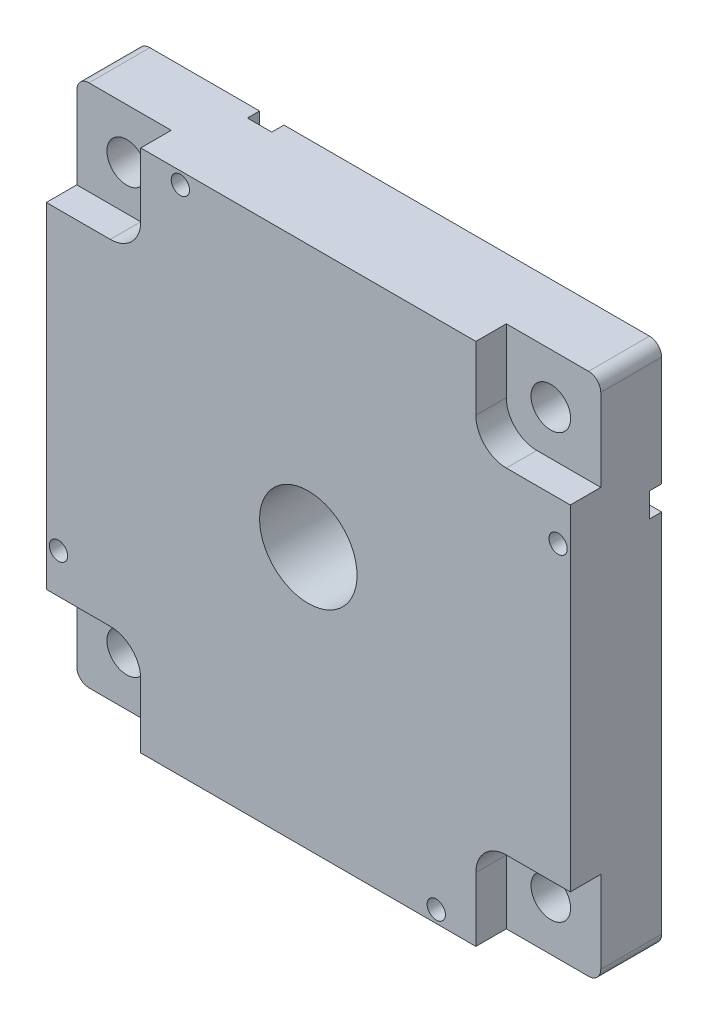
from build123d import *

# Parameters (mm, degrees)
SKETCH_2_W               = 86
SKETCH_2_H               = 86
EXTRUDE_1_DEPTH          = 10
SKETCH_3_R               = 3.25
CUT_EXTRUDE_1_DEPTH      = 10
SKETCH_4_R               = 37
SKETCH_4_R_2             = 36.5
CUT_EXTRUDE_2_DEPTH      = 0.5
EXTRUDE_START            = 1.6
SKETCH_5_R               = 36.5
EXTRUDE_2_DEPTH          = 1.6
SKETCH_6_R               = 21
SKETCH_6_R_2             = 20
CUT_EXTRUDE_3_DEPTH      = 0.5
SKETCH_7_R               = 8
CUT_EXTRUDE_4_DEPTH      = 80
PATTERN_CIRCULAR_1_COUNT = 4
FILLET_1_R               = 2
FILLET_2_R               = 2
FILLET_3_R               = 2
FILLET_4_R               = 2
EXTRUDE_3_DEPTH          = 5
FILLET_5_R               = 5
CUT_EXTRUDE_START        = -5
SKETCH_9_R               = 8
CUT_EXTRUDE_5_DEPTH      = 5
FILLET_6_R               = 5
FILLET_7_R               = 5
FILLET_8_R               = 5
CUT_EXTRUDE_6_DEPTH      = 2
PATTERN_CIRCULAR_2_COUNT = 4
SKETCH_11_R              = 1.5
CUT_EXTRUDE_7_DEPTH      = 50
PATTERN_CIRCULAR_3_COUNT = 4


with BuildPart() as part:
    # Sketch 2 → Extrude 1 (new body)
    with BuildSketch(Plane.XY):
        Rectangle(SKETCH_2_W, SKETCH_2_H)
    extrude(amount=EXTRUDE_1_DEPTH)

    # Sketch 3 → Cut-Extrude 1 (cut)
    with BuildSketch(Plane(origin=(0, 0, 0), x_dir=(-1, 0, 0), z_dir=(0, 0, -1))):
        with Locations((-34.8, 34.8)):
            Circle(SKETCH_3_R)
    cut_extrude_1 = extrude(amount=-CUT_EXTRUDE_1_DEPTH, mode=Mode.SUBTRACT)

    # Sketch 4 → Cut-Extrude 2 (cut)
    with BuildSketch(Plane(origin=(0, 0, 0), x_dir=(-1, 0, 0), z_dir=(0, 0, -1))):
        Circle(SKETCH_4_R)
        Circle(SKETCH_4_R_2, mode=Mode.SUBTRACT)
    extrude(amount=-CUT_EXTRUDE_2_DEPTH, mode=Mode.SUBTRACT)

    # Sketch 5 → Extrude 2 (add)
    with BuildSketch(Plane(origin=(0, 0, 0), x_dir=(-1, 0, 0), z_dir=(0, 0, -1)).offset(EXTRUDE_START)):
        Circle(SKETCH_5_R)
    extrude(amount=-EXTRUDE_2_DEPTH)

    # Sketch 6 → Cut-Extrude 3 (cut)
    with BuildSketch(Plane(origin=(0, 0, -1.6), x_dir=(-1, 0, 0), z_dir=(0, 0, -1))):
        Circle(SKETCH_6_R)
        Circle(SKETCH_6_R_2, mode=Mode.SUBTRACT)
    extrude(amount=-CUT_EXTRUDE_3_DEPTH, mode=Mode.SUBTRACT)

    # Sketch 7 → Cut-Extrude 4 (cut)
    with BuildSketch(Plane(origin=(0, 0, -1.6), x_dir=(-1, 0, 0), z_dir=(0, 0, -1))):
        Circle(SKETCH_7_R)
    extrude(amount=-CUT_EXTRUDE_4_DEPTH, mode=Mode.SUBTRACT)

    # Pattern Circular 1: Cut-Extrude 1 ×4 about axis
    pattern_circular_1_axis = Axis((0, 0, 0), (0, 0, 1))
    for i in range(1, PATTERN_CIRCULAR_1_COUNT):
        add(cut_extrude_1.rotate(pattern_circular_1_axis, i * 360 / PATTERN_CIRCULAR_1_COUNT), mode=Mode.SUBTRACT)

    # Fillet 1
    fillet_1_edges = [part.edges().sort_by_distance(p)[0] for p in [
        (43, 43, 5),
    ]]
    fillet(fillet_1_edges, radius=FILLET_1_R)

    # Fillet 2
    fillet_2_edges = [part.edges().sort_by_distance(p)[0] for p in [
        (-43, 43, 5),
    ]]
    fillet(fillet_2_edges, radius=FILLET_2_R)

    # Fillet 3
    fillet_3_edges = [part.edges().sort_by_distance(p)[0] for p in [
        (-43, -43, 5),
    ]]
    fillet(fillet_3_edges, radius=FILLET_3_R)

    # Fillet 4
    fillet_4_edges = [part.edges().sort_by_distance(p)[0] for p in [
        (43, -43, 5),
    ]]
    fillet(fillet_4_edges, radius=FILLET_4_R)

    # Sketch 8 → Extrude 3 (add)
    with BuildSketch(Plane.XY.offset(10)):
        Polygon((27.5, -43), (-27.5, -43), (-27.5, -27.5), (-43, -27.5), (-43, 27.5), (-27.5, 27.5), (-27.5, 43), (27.5, 43), (27.5, 27.5), (43, 27.5), (43, -27.5), (27.5, -27.5), align=None)
    extrude(amount=EXTRUDE_3_DEPTH)

    # Fillet 5
    fillet_5_edges = [part.edges().sort_by_distance(p)[0] for p in [
        (27.5, 27.5, 12.5),
    ]]
    fillet(fillet_5_edges, radius=FILLET_5_R)

    # Sketch 9 → Cut-Extrude 5 (cut)
    with BuildSketch(Plane.XY.offset(15).offset(CUT_EXTRUDE_START)):
        with Locations(Location((0, 0, 0), (0, 0, 180))):
            Circle(SKETCH_9_R)
    extrude(amount=CUT_EXTRUDE_5_DEPTH, mode=Mode.SUBTRACT)

    # Fillet 6
    fillet_6_edges = [part.edges().sort_by_distance(p)[0] for p in [
        (-27.5, 27.5, 12.5),
    ]]
    fillet(fillet_6_edges, radius=FILLET_6_R)

    # Fillet 7
    fillet_7_edges = [part.edges().sort_by_distance(p)[0] for p in [
        (-27.5, -27.5, 12.5),
    ]]
    fillet(fillet_7_edges, radius=FILLET_7_R)

    # Fillet 8
    fillet_8_edges = [part.edges().sort_by_distance(p)[0] for p in [
        (27.5, -27.5, 12.5),
    ]]
    fillet(fillet_8_edges, radius=FILLET_8_R)

    # Sketch 10 → Cut-Extrude 6 (cut)
    with BuildSketch(Plane(origin=(0, 0, 0), x_dir=(-1, 0, 0), z_dir=(0, 0, -1))):
        with BuildLine():
            Line((23, 41), (23, 43))
            Line((23, 43), (19, 43))
            Line((19, 43), (19, 41))
            ThreePointArc((19, 41), (21, 39), (23, 41))
        make_face()
    cut_extrude_6 = extrude(amount=-CUT_EXTRUDE_6_DEPTH, mode=Mode.SUBTRACT)

    # Pattern Circular 2: Cut-Extrude 6 ×4 about axis
    pattern_circular_2_axis = Axis((0, 0, 0), (0, 0, 1))
    for i in range(1, PATTERN_CIRCULAR_2_COUNT):
        add(cut_extrude_6.rotate(pattern_circular_2_axis, i * 360 / PATTERN_CIRCULAR_2_COUNT), mode=Mode.SUBTRACT)

    # Sketch 11 → Cut-Extrude 7 (cut)
    with BuildSketch(Plane(origin=(0, 0, 0), x_dir=(-1, 0, 0), z_dir=(0, 0, -1))):
        with Locations((21, 41)):
            Circle(SKETCH_11_R)
    cut_extrude_7 = extrude(amount=-CUT_EXTRUDE_7_DEPTH, mode=Mode.SUBTRACT)

    # Pattern Circular 3: Cut-Extrude 7 ×4 about axis
    pattern_circular_3_axis = Axis((0, 0, 0), (0, 0, 1))
    for i in range(1, PATTERN_CIRCULAR_3_COUNT):
        add(cut_extrude_7.rotate(pattern_circular_3_axis, i * 360 / PATTERN_CIRCULAR_3_COUNT), mode=Mode.SUBTRACT)


solid = part.part
